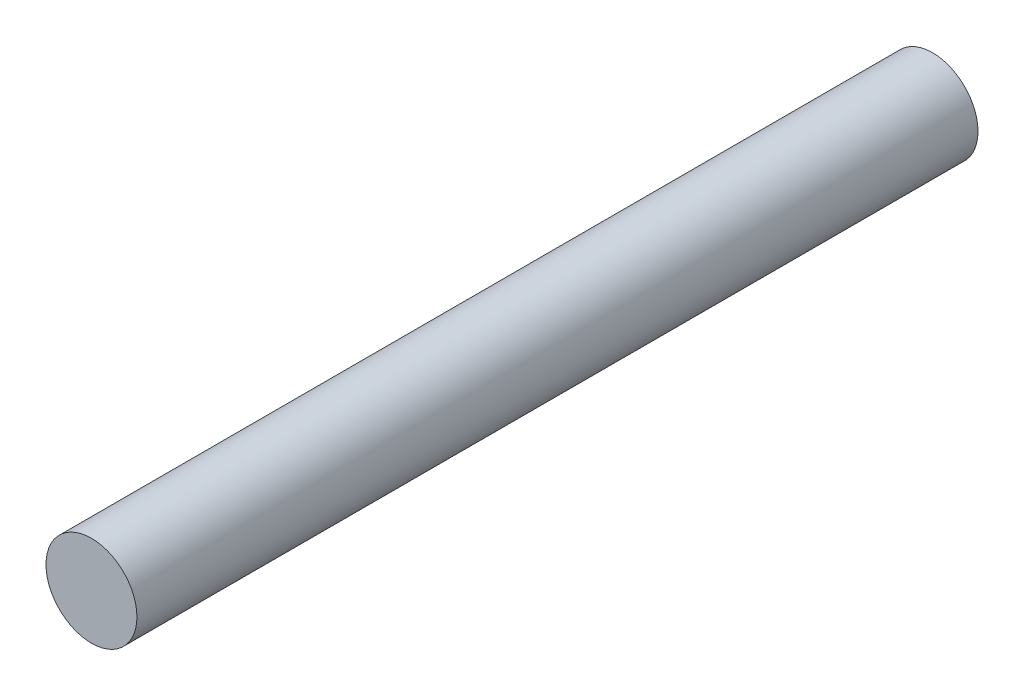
ISO-10303-21;
HEADER;
FILE_DESCRIPTION(('STEP AP214'),'2;1');
FILE_NAME('part.step','',(''),(''),'','','');
FILE_SCHEMA(('AUTOMOTIVE_DESIGN { 1 0 10303 214 1 1 1 1 }'));
ENDSEC;
DATA;
#1=APPLICATION_CONTEXT('core data for automotive mechanical design processes');
#2=APPLICATION_PROTOCOL_DEFINITION('international standard','automotive_design',2000,#1);
#3=PRODUCT_CONTEXT('',#1,'mechanical');
#4=PRODUCT('Part','Part','',(#3));
#5=PRODUCT_RELATED_PRODUCT_CATEGORY('part','',(#4));
#6=PRODUCT_DEFINITION_FORMATION('','',#4);
#7=PRODUCT_DEFINITION_CONTEXT('part definition',#1,'design');
#8=PRODUCT_DEFINITION('design','',#6,#7);
#9=PRODUCT_DEFINITION_SHAPE('','',#8);
#10=(LENGTH_UNIT() NAMED_UNIT(*) SI_UNIT(.MILLI.,.METRE.));
#11=(NAMED_UNIT(*) PLANE_ANGLE_UNIT() SI_UNIT($,.RADIAN.));
#12=(NAMED_UNIT(*) SI_UNIT($,.STERADIAN.) SOLID_ANGLE_UNIT());
#13=UNCERTAINTY_MEASURE_WITH_UNIT(LENGTH_MEASURE(1.E-05),#10,'distance_accuracy_value','');
#14=(GEOMETRIC_REPRESENTATION_CONTEXT(3) GLOBAL_UNCERTAINTY_ASSIGNED_CONTEXT((#13)) GLOBAL_UNIT_ASSIGNED_CONTEXT((#10,
#11,#12)) REPRESENTATION_CONTEXT('',''));
#15=CARTESIAN_POINT('',(0.,0.,0.));
#16=DIRECTION('',(0.,0.,1.));
#17=DIRECTION('',(1.,0.,0.));
#18=AXIS2_PLACEMENT_3D('',#15,#16,#17);
#19=CARTESIAN_POINT('',(0.,0.,37.));
#20=DIRECTION('',(0.,0.,1.));
#21=DIRECTION('',(1.,0.,0.));
#22=AXIS2_PLACEMENT_3D('',#19,#20,#21);
#23=PLANE('',#22);
#24=CARTESIAN_POINT('',(0.,0.,37.));
#25=DIRECTION('',(0.,0.,-1.));
#26=DIRECTION('',(-1.,0.,0.));
#27=AXIS2_PLACEMENT_3D('',#24,#25,#26);
#28=CIRCLE('',#27,4.);
#29=CARTESIAN_POINT('',(-4.,0.,37.));
#30=VERTEX_POINT('',#29);
#31=EDGE_CURVE('E10',#30,#30,#28,.T.);
#32=ORIENTED_EDGE('',*,*,#31,.F.);
#33=EDGE_LOOP('',(#32));
#34=FACE_BOUND('',#33,.T.);
#35=ADVANCED_FACE('F15',(#34),#23,.T.);
#36=CARTESIAN_POINT('',(0.,0.,-37.));
#37=DIRECTION('',(0.,0.,-1.));
#38=DIRECTION('',(-1.,0.,0.));
#39=AXIS2_PLACEMENT_3D('',#36,#37,#38);
#40=PLANE('',#39);
#41=CARTESIAN_POINT('',(0.,0.,-37.));
#42=DIRECTION('',(0.,0.,1.));
#43=DIRECTION('',(1.,0.,0.));
#44=AXIS2_PLACEMENT_3D('',#41,#42,#43);
#45=CIRCLE('',#44,4.);
#46=CARTESIAN_POINT('',(4.,0.,-37.));
#47=VERTEX_POINT('',#46);
#48=EDGE_CURVE('E22',#47,#47,#45,.T.);
#49=ORIENTED_EDGE('',*,*,#48,.F.);
#50=EDGE_LOOP('',(#49));
#51=FACE_BOUND('',#50,.T.);
#52=ADVANCED_FACE('F26',(#51),#40,.T.);
#53=CARTESIAN_POINT('',(0.,0.,-37.));
#54=DIRECTION('',(0.,0.,1.));
#55=DIRECTION('',(1.,0.,0.));
#56=AXIS2_PLACEMENT_3D('',#53,#54,#55);
#57=CYLINDRICAL_SURFACE('',#56,4.);
#58=ORIENTED_EDGE('',*,*,#31,.T.);
#59=EDGE_LOOP('',(#58));
#60=FACE_BOUND('',#59,.T.);
#61=ORIENTED_EDGE('',*,*,#48,.T.);
#62=EDGE_LOOP('',(#61));
#63=FACE_BOUND('',#62,.T.);
#64=ADVANCED_FACE('F17',(#60,#63),#57,.T.);
#65=CLOSED_SHELL('',(#35,#52,#64));
#66=MANIFOLD_SOLID_BREP('B1',#65);
#67=ADVANCED_BREP_SHAPE_REPRESENTATION('',(#18,#66),#14);
#68=SHAPE_DEFINITION_REPRESENTATION(#9,#67);
ENDSEC;
END-ISO-10303-21;
